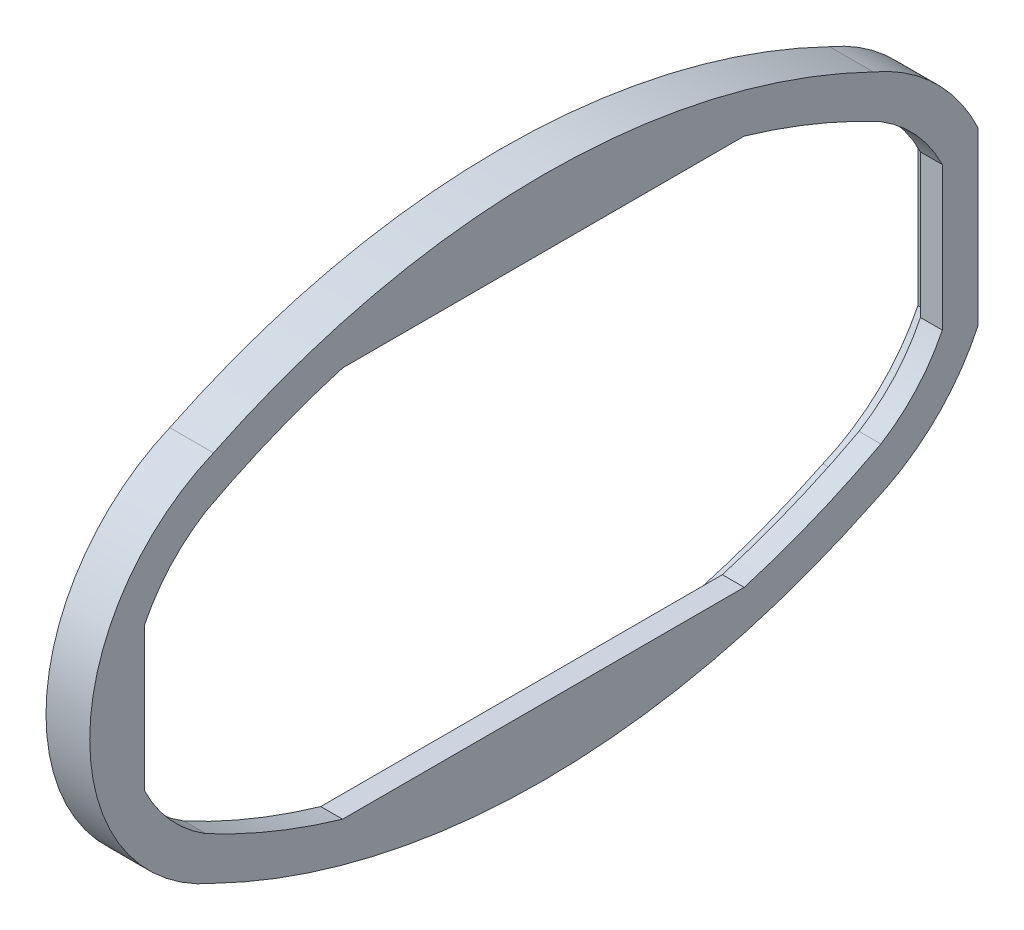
from build123d import *

# Parameters (mm, degrees)
EXTRUDE1_DEPTH      = 2
EXTRUDE2_DEPTH      = 2
CUT_EXTRUDE1_DEPTH  = 49.106652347
F_0_5MM_PAINT_DEPTH = 49.106652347


with BuildPart() as part:
    # Sketch1 → Extrude1 (new body)
    with BuildSketch(Plane(origin=(0, 0, 0), x_dir=(0, 0, -1), z_dir=(1, 0, 0))):
        with BuildLine():
            Line((39.756146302, 7.841017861), (39.756146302, -7.841017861))
            ThreePointArc((39.756146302, -7.841017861), (35.822415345, -13.335503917), (30.177894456, -17.050742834))
            ThreePointArc((30.177894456, -17.050742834), (15.483842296, -22.240245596), (0, -24))
            ThreePointArc((0, -24), (-15.483842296, -22.240245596), (-30.177894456, -17.050742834))
            ThreePointArc((-30.177894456, -17.050742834), (-41.5, 0), (-30.177894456, 17.050742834))
            ThreePointArc((-30.177894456, 17.050742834), (-15.483842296, 22.240245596), (0, 24))
            ThreePointArc((0, 24), (15.483842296, 22.240245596), (30.177894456, 17.050742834))
            ThreePointArc((30.177894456, 17.050742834), (35.822415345, 13.335503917), (39.756146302, 7.841017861))
        make_face()
        with BuildLine():
            Line((38.256146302, 7.5), (38.256146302, -7.5))
            ThreePointArc((38.256146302, -7.5), (34.649825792, -12.380692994), (29.558990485, -15.683738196))
            ThreePointArc((29.558990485, -15.683738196), (15.167360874, -20.773863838), (0, -22.5))
            ThreePointArc((0, -22.5), (-15.167360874, -20.773863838), (-29.558990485, -15.683738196))
            ThreePointArc((-29.558990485, -15.683738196), (-40, 0), (-29.558990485, 15.683738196))
            ThreePointArc((-29.558990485, 15.683738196), (-15.167360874, 20.773863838), (0, 22.5))
            ThreePointArc((0, 22.5), (15.167360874, 20.773863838), (29.558990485, 15.683738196))
            ThreePointArc((29.558990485, 15.683738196), (34.649825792, 12.380692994), (38.256146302, 7.5))
        make_face(mode=Mode.SUBTRACT)
    extrude(amount=EXTRUDE1_DEPTH)

    # Sketch2 → Extrude2 (add)
    with BuildSketch(Plane(origin=(2, 0, 0), x_dir=(0, 0, -1), z_dir=(1, 0, 0))):
        with BuildLine():
            Line((39.756146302, 7.841017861), (39.756146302, -7.841017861))
            ThreePointArc((39.756146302, -7.841017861), (35.822415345, -13.335503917), (30.177894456, -17.050742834))
            ThreePointArc((30.177894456, -17.050742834), (0, -24), (-30.177894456, -17.050742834))
            ThreePointArc((-30.177894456, -17.050742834), (-41.5, 0), (-30.177894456, 17.050742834))
            ThreePointArc((-30.177894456, 17.050742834), (0, 24), (30.177894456, 17.050742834))
            ThreePointArc((30.177894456, 17.050742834), (35.822415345, 13.335503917), (39.756146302, 7.841017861))
        make_face()
    extrude(amount=EXTRUDE2_DEPTH)

    # Sketch4 → Cut-Extrude1 (cut, through all)
    with BuildSketch(Plane(origin=(4, 0, 0), x_dir=(0, 0, -1), z_dir=(1, 0, 0))):
        with BuildLine():
            Line((35.990381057, -7.5), (35.990381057, 7.5))
            ThreePointArc((35.990381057, 7.5), (33.759368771, 10.451601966), (30.873738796, 12.767311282))
            ThreePointArc((30.873738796, 12.767311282), (25.540845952, 15.315132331), (20, 17.371868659))
            Line((20, 17.371868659), (-20, 17.371868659))
            ThreePointArc((-20, 17.371868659), (-25.540845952, 15.315132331), (-30.873738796, 12.767311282))
            ThreePointArc((-30.873738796, 12.767311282), (-33.759368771, 10.451601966), (-35.990381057, 7.5))
            Line((-35.990381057, 7.5), (-35.990381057, -7.5))
            ThreePointArc((-35.990381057, -7.5), (-33.759368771, -10.451601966), (-30.873738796, -12.767311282))
            ThreePointArc((-30.873738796, -12.767311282), (-25.540845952, -15.315132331), (-20, -17.371868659))
            Line((-20, -17.371868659), (20, -17.371868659))
            ThreePointArc((20, -17.371868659), (25.540845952, -15.315132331), (30.873738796, -12.767311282))
            ThreePointArc((30.873738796, -12.767311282), (33.759368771, -10.451601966), (35.990381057, -7.5))
        make_face()
    extrude(amount=-CUT_EXTRUDE1_DEPTH, mode=Mode.SUBTRACT)

    # Sketch5 → 0.5mm_paint (cut, through all)
    with BuildSketch(Plane(origin=(4, 0, 0), x_dir=(0, 0, -1), z_dir=(1, 0, 0))):
        with BuildLine():
            Line((-36.490381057, 6.558171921), (-36.490381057, -6.558171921))
            ThreePointArc((-36.490381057, -6.558171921), (-34.124062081, -10.062566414), (-30.873738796, -12.767311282))
            ThreePointArc((-30.873738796, -12.767311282), (-24.752732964, -15.642824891), (-18.367855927, -17.871868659))
            Line((-18.367855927, -17.871868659), (18.367855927, -17.871868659))
            ThreePointArc((18.367855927, -17.871868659), (24.752732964, -15.642824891), (30.873738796, -12.767311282))
            ThreePointArc((30.873738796, -12.767311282), (34.124062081, -10.062566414), (36.490381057, -6.558171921))
            Line((36.490381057, -6.558171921), (36.490381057, 6.558171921))
            ThreePointArc((36.490381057, 6.558171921), (34.124062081, 10.062566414), (30.873738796, 12.767311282))
            ThreePointArc((30.873738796, 12.767311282), (24.752732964, 15.642824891), (18.367855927, 17.871868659))
            Line((18.367855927, 17.871868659), (-18.367855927, 17.871868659))
            ThreePointArc((-18.367855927, 17.871868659), (-24.752732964, 15.642824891), (-30.873738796, 12.767311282))
            ThreePointArc((-30.873738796, 12.767311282), (-34.124062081, 10.062566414), (-36.490381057, 6.558171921))
        make_face()
    extrude(amount=-F_0_5MM_PAINT_DEPTH, mode=Mode.SUBTRACT)


solid = part.part
